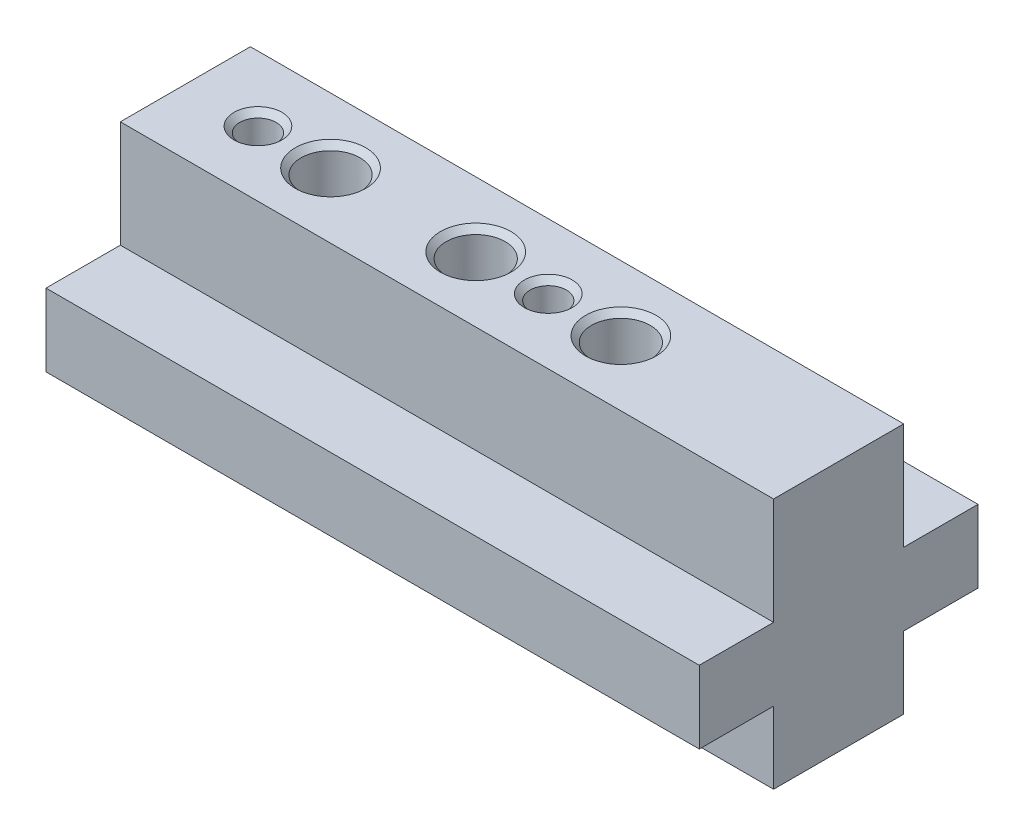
ISO-10303-21;
HEADER;
FILE_DESCRIPTION(('STEP AP214'),'2;1');
FILE_NAME('part.step','',(''),(''),'','','');
FILE_SCHEMA(('AUTOMOTIVE_DESIGN { 1 0 10303 214 1 1 1 1 }'));
ENDSEC;
DATA;
#1=APPLICATION_CONTEXT('core data for automotive mechanical design processes');
#2=APPLICATION_PROTOCOL_DEFINITION('international standard','automotive_design',2000,#1);
#3=PRODUCT_CONTEXT('',#1,'mechanical');
#4=PRODUCT('Part','Part','',(#3));
#5=PRODUCT_RELATED_PRODUCT_CATEGORY('part','',(#4));
#6=PRODUCT_DEFINITION_FORMATION('','',#4);
#7=PRODUCT_DEFINITION_CONTEXT('part definition',#1,'design');
#8=PRODUCT_DEFINITION('design','',#6,#7);
#9=PRODUCT_DEFINITION_SHAPE('','',#8);
#10=(LENGTH_UNIT() NAMED_UNIT(*) SI_UNIT(.MILLI.,.METRE.));
#11=(NAMED_UNIT(*) PLANE_ANGLE_UNIT() SI_UNIT($,.RADIAN.));
#12=(NAMED_UNIT(*) SI_UNIT($,.STERADIAN.) SOLID_ANGLE_UNIT());
#13=UNCERTAINTY_MEASURE_WITH_UNIT(LENGTH_MEASURE(1.E-05),#10,'distance_accuracy_value','');
#14=(GEOMETRIC_REPRESENTATION_CONTEXT(3) GLOBAL_UNCERTAINTY_ASSIGNED_CONTEXT((#13)) GLOBAL_UNIT_ASSIGNED_CONTEXT((#10,
#11,#12)) REPRESENTATION_CONTEXT('',''));
#15=CARTESIAN_POINT('',(0.,0.,0.));
#16=DIRECTION('',(0.,0.,1.));
#17=DIRECTION('',(1.,0.,0.));
#18=AXIS2_PLACEMENT_3D('',#15,#16,#17);
#19=CARTESIAN_POINT('',(28.575,1.5875,2.8448));
#20=DIRECTION('',(0.,-1.,0.));
#21=DIRECTION('',(0.,0.,-1.));
#22=AXIS2_PLACEMENT_3D('',#19,#20,#21);
#23=PLANE('',#22);
#24=DIRECTION('',(0.,0.,1.));
#25=VECTOR('',#24,1.);
#26=CARTESIAN_POINT('',(0.,1.5875,2.8448));
#27=LINE('',#26,#25);
#28=CARTESIAN_POINT('',(0.,1.5875,2.8448));
#29=VERTEX_POINT('',#28);
#30=CARTESIAN_POINT('',(0.,1.5875,6.096));
#31=VERTEX_POINT('',#30);
#32=EDGE_CURVE('E162',#29,#31,#27,.T.);
#33=ORIENTED_EDGE('',*,*,#32,.T.);
#34=DIRECTION('',(-1.,0.,0.));
#35=VECTOR('',#34,1.);
#36=CARTESIAN_POINT('',(28.575,1.5875,6.096));
#37=LINE('',#36,#35);
#38=CARTESIAN_POINT('',(28.575,1.5875,6.096));
#39=VERTEX_POINT('',#38);
#40=EDGE_CURVE('E210',#39,#31,#37,.T.);
#41=ORIENTED_EDGE('',*,*,#40,.F.);
#42=DIRECTION('',(0.,0.,1.));
#43=VECTOR('',#42,1.);
#44=CARTESIAN_POINT('',(28.575,1.5875,2.8448));
#45=LINE('',#44,#43);
#46=CARTESIAN_POINT('',(28.575,1.5875,2.8448));
#47=VERTEX_POINT('',#46);
#48=EDGE_CURVE('E185',#47,#39,#45,.T.);
#49=ORIENTED_EDGE('',*,*,#48,.F.);
#50=DIRECTION('',(-1.,0.,0.));
#51=VECTOR('',#50,1.);
#52=CARTESIAN_POINT('',(28.575,1.5875,2.8448));
#53=LINE('',#52,#51);
#54=EDGE_CURVE('E158',#47,#29,#53,.T.);
#55=ORIENTED_EDGE('',*,*,#54,.T.);
#56=EDGE_LOOP('',(#33,#41,#49,#55));
#57=FACE_BOUND('',#56,.T.);
#58=ADVANCED_FACE('F37',(#57),#23,.F.);
#59=CARTESIAN_POINT('',(28.575,1.5875,6.096));
#60=DIRECTION('',(0.,0.,-1.));
#61=DIRECTION('',(-1.,0.,0.));
#62=AXIS2_PLACEMENT_3D('',#59,#60,#61);
#63=PLANE('',#62);
#64=DIRECTION('',(0.,-1.,0.));
#65=VECTOR('',#64,1.);
#66=CARTESIAN_POINT('',(0.,1.5875,6.096));
#67=LINE('',#66,#65);
#68=CARTESIAN_POINT('',(0.,-1.5875,6.096));
#69=VERTEX_POINT('',#68);
#70=EDGE_CURVE('E165',#31,#69,#67,.T.);
#71=ORIENTED_EDGE('',*,*,#70,.T.);
#72=DIRECTION('',(-1.,0.,0.));
#73=VECTOR('',#72,1.);
#74=CARTESIAN_POINT('',(28.575,-1.5875,6.096));
#75=LINE('',#74,#73);
#76=CARTESIAN_POINT('',(28.575,-1.5875,6.096));
#77=VERTEX_POINT('',#76);
#78=EDGE_CURVE('E207',#77,#69,#75,.T.);
#79=ORIENTED_EDGE('',*,*,#78,.F.);
#80=DIRECTION('',(0.,-1.,0.));
#81=VECTOR('',#80,1.);
#82=CARTESIAN_POINT('',(28.575,1.5875,6.096));
#83=LINE('',#82,#81);
#84=EDGE_CURVE('E111',#39,#77,#83,.T.);
#85=ORIENTED_EDGE('',*,*,#84,.F.);
#86=ORIENTED_EDGE('',*,*,#40,.T.);
#87=EDGE_LOOP('',(#71,#79,#85,#86));
#88=FACE_BOUND('',#87,.T.);
#89=ADVANCED_FACE('F255',(#88),#63,.F.);
#90=CARTESIAN_POINT('',(28.575,-1.5875,6.096));
#91=DIRECTION('',(0.,1.,0.));
#92=DIRECTION('',(0.,0.,1.));
#93=AXIS2_PLACEMENT_3D('',#90,#91,#92);
#94=PLANE('',#93);
#95=DIRECTION('',(0.,0.,-1.));
#96=VECTOR('',#95,1.);
#97=CARTESIAN_POINT('',(0.,-1.5875,6.096));
#98=LINE('',#97,#96);
#99=CARTESIAN_POINT('',(0.,-1.5875,2.8448));
#100=VERTEX_POINT('',#99);
#101=EDGE_CURVE('E168',#69,#100,#98,.T.);
#102=ORIENTED_EDGE('',*,*,#101,.T.);
#103=DIRECTION('',(-1.,0.,0.));
#104=VECTOR('',#103,1.);
#105=CARTESIAN_POINT('',(28.575,-1.5875,2.8448));
#106=LINE('',#105,#104);
#107=CARTESIAN_POINT('',(28.575,-1.5875,2.8448));
#108=VERTEX_POINT('',#107);
#109=EDGE_CURVE('E204',#108,#100,#106,.T.);
#110=ORIENTED_EDGE('',*,*,#109,.F.);
#111=DIRECTION('',(0.,0.,-1.));
#112=VECTOR('',#111,1.);
#113=CARTESIAN_POINT('',(28.575,-1.5875,6.096));
#114=LINE('',#113,#112);
#115=EDGE_CURVE('E303',#77,#108,#114,.T.);
#116=ORIENTED_EDGE('',*,*,#115,.F.);
#117=ORIENTED_EDGE('',*,*,#78,.T.);
#118=EDGE_LOOP('',(#102,#110,#116,#117));
#119=FACE_BOUND('',#118,.T.);
#120=ADVANCED_FACE('F261',(#119),#94,.F.);
#121=CARTESIAN_POINT('',(28.575,-1.5875,2.8448));
#122=DIRECTION('',(0.,0.,-1.));
#123=DIRECTION('',(0.,1.,0.));
#124=AXIS2_PLACEMENT_3D('',#121,#122,#123);
#125=PLANE('',#124);
#126=DIRECTION('',(0.,-1.,0.));
#127=VECTOR('',#126,1.);
#128=CARTESIAN_POINT('',(0.,-1.5875,2.8448));
#129=LINE('',#128,#127);
#130=CARTESIAN_POINT('',(0.,-4.7371,2.8448));
#131=VERTEX_POINT('',#130);
#132=EDGE_CURVE('E170',#100,#131,#129,.T.);
#133=ORIENTED_EDGE('',*,*,#132,.T.);
#134=DIRECTION('',(-1.,0.,0.));
#135=VECTOR('',#134,1.);
#136=CARTESIAN_POINT('',(28.575,-4.7371,2.8448));
#137=LINE('',#136,#135);
#138=CARTESIAN_POINT('',(28.575,-4.7371,2.8448));
#139=VERTEX_POINT('',#138);
#140=EDGE_CURVE('E201',#139,#131,#137,.T.);
#141=ORIENTED_EDGE('',*,*,#140,.F.);
#142=DIRECTION('',(0.,-1.,0.));
#143=VECTOR('',#142,1.);
#144=CARTESIAN_POINT('',(28.575,-1.5875,2.8448));
#145=LINE('',#144,#143);
#146=EDGE_CURVE('E305',#108,#139,#145,.T.);
#147=ORIENTED_EDGE('',*,*,#146,.F.);
#148=ORIENTED_EDGE('',*,*,#109,.T.);
#149=EDGE_LOOP('',(#133,#141,#147,#148));
#150=FACE_BOUND('',#149,.T.);
#151=ADVANCED_FACE('F359',(#150),#125,.F.);
#152=CARTESIAN_POINT('',(28.575,-4.7371,2.8448));
#153=DIRECTION('',(0.,1.,0.));
#154=DIRECTION('',(0.,0.,1.));
#155=AXIS2_PLACEMENT_3D('',#152,#153,#154);
#156=PLANE('',#155);
#157=DIRECTION('',(0.,0.,-1.));
#158=VECTOR('',#157,1.);
#159=CARTESIAN_POINT('',(0.,-4.7371,2.8448));
#160=LINE('',#159,#158);
#161=CARTESIAN_POINT('',(0.,-4.7371,-2.8448));
#162=VERTEX_POINT('',#161);
#163=EDGE_CURVE('E172',#131,#162,#160,.T.);
#164=ORIENTED_EDGE('',*,*,#163,.T.);
#165=DIRECTION('',(-1.,0.,0.));
#166=VECTOR('',#165,1.);
#167=CARTESIAN_POINT('',(28.575,-4.7371,-2.8448));
#168=LINE('',#167,#166);
#169=CARTESIAN_POINT('',(28.575,-4.7371,-2.8448));
#170=VERTEX_POINT('',#169);
#171=EDGE_CURVE('E198',#170,#162,#168,.T.);
#172=ORIENTED_EDGE('',*,*,#171,.F.);
#173=DIRECTION('',(0.,0.,-1.));
#174=VECTOR('',#173,1.);
#175=CARTESIAN_POINT('',(28.575,-4.7371,2.8448));
#176=LINE('',#175,#174);
#177=EDGE_CURVE('E307',#139,#170,#176,.T.);
#178=ORIENTED_EDGE('',*,*,#177,.F.);
#179=ORIENTED_EDGE('',*,*,#140,.T.);
#180=EDGE_LOOP('',(#164,#172,#178,#179));
#181=FACE_BOUND('',#180,.T.);
#182=ADVANCED_FACE('F355',(#181),#156,.F.);
#183=CARTESIAN_POINT('',(28.575,-4.7371,-2.8448));
#184=DIRECTION('',(0.,0.,1.));
#185=DIRECTION('',(0.,-1.,0.));
#186=AXIS2_PLACEMENT_3D('',#183,#184,#185);
#187=PLANE('',#186);
#188=DIRECTION('',(0.,1.,0.));
#189=VECTOR('',#188,1.);
#190=CARTESIAN_POINT('',(0.,-4.7371,-2.8448));
#191=LINE('',#190,#189);
#192=CARTESIAN_POINT('',(0.,-1.5875,-2.8448));
#193=VERTEX_POINT('',#192);
#194=EDGE_CURVE('E174',#162,#193,#191,.T.);
#195=ORIENTED_EDGE('',*,*,#194,.T.);
#196=DIRECTION('',(-1.,0.,0.));
#197=VECTOR('',#196,1.);
#198=CARTESIAN_POINT('',(28.575,-1.5875,-2.8448));
#199=LINE('',#198,#197);
#200=CARTESIAN_POINT('',(28.575,-1.5875,-2.8448));
#201=VERTEX_POINT('',#200);
#202=EDGE_CURVE('E195',#201,#193,#199,.T.);
#203=ORIENTED_EDGE('',*,*,#202,.F.);
#204=DIRECTION('',(0.,1.,0.));
#205=VECTOR('',#204,1.);
#206=CARTESIAN_POINT('',(28.575,-4.7371,-2.8448));
#207=LINE('',#206,#205);
#208=EDGE_CURVE('E309',#170,#201,#207,.T.);
#209=ORIENTED_EDGE('',*,*,#208,.F.);
#210=ORIENTED_EDGE('',*,*,#171,.T.);
#211=EDGE_LOOP('',(#195,#203,#209,#210));
#212=FACE_BOUND('',#211,.T.);
#213=ADVANCED_FACE('F351',(#212),#187,.F.);
#214=CARTESIAN_POINT('',(28.575,-1.5875,-2.8448));
#215=DIRECTION('',(0.,1.,0.));
#216=DIRECTION('',(0.,0.,1.));
#217=AXIS2_PLACEMENT_3D('',#214,#215,#216);
#218=PLANE('',#217);
#219=DIRECTION('',(0.,0.,-1.));
#220=VECTOR('',#219,1.);
#221=CARTESIAN_POINT('',(0.,-1.5875,-2.8448));
#222=LINE('',#221,#220);
#223=CARTESIAN_POINT('',(0.,-1.5875,-6.096));
#224=VERTEX_POINT('',#223);
#225=EDGE_CURVE('E176',#193,#224,#222,.T.);
#226=ORIENTED_EDGE('',*,*,#225,.T.);
#227=DIRECTION('',(-1.,0.,0.));
#228=VECTOR('',#227,1.);
#229=CARTESIAN_POINT('',(28.575,-1.5875,-6.096));
#230=LINE('',#229,#228);
#231=CARTESIAN_POINT('',(28.575,-1.5875,-6.096));
#232=VERTEX_POINT('',#231);
#233=EDGE_CURVE('E192',#232,#224,#230,.T.);
#234=ORIENTED_EDGE('',*,*,#233,.F.);
#235=DIRECTION('',(0.,0.,-1.));
#236=VECTOR('',#235,1.);
#237=CARTESIAN_POINT('',(28.575,-1.5875,-2.8448));
#238=LINE('',#237,#236);
#239=EDGE_CURVE('E311',#201,#232,#238,.T.);
#240=ORIENTED_EDGE('',*,*,#239,.F.);
#241=ORIENTED_EDGE('',*,*,#202,.T.);
#242=EDGE_LOOP('',(#226,#234,#240,#241));
#243=FACE_BOUND('',#242,.T.);
#244=ADVANCED_FACE('F348',(#243),#218,.F.);
#245=CARTESIAN_POINT('',(28.575,-1.5875,-6.096));
#246=DIRECTION('',(0.,0.,1.));
#247=DIRECTION('',(1.,0.,0.));
#248=AXIS2_PLACEMENT_3D('',#245,#246,#247);
#249=PLANE('',#248);
#250=DIRECTION('',(0.,1.,0.));
#251=VECTOR('',#250,1.);
#252=CARTESIAN_POINT('',(0.,-1.5875,-6.096));
#253=LINE('',#252,#251);
#254=CARTESIAN_POINT('',(0.,1.5875,-6.096));
#255=VERTEX_POINT('',#254);
#256=EDGE_CURVE('E178',#224,#255,#253,.T.);
#257=ORIENTED_EDGE('',*,*,#256,.T.);
#258=DIRECTION('',(-1.,0.,0.));
#259=VECTOR('',#258,1.);
#260=CARTESIAN_POINT('',(28.575,1.5875,-6.096));
#261=LINE('',#260,#259);
#262=CARTESIAN_POINT('',(28.575,1.5875,-6.096));
#263=VERTEX_POINT('',#262);
#264=EDGE_CURVE('E189',#263,#255,#261,.T.);
#265=ORIENTED_EDGE('',*,*,#264,.F.);
#266=DIRECTION('',(0.,1.,0.));
#267=VECTOR('',#266,1.);
#268=CARTESIAN_POINT('',(28.575,-1.5875,-6.096));
#269=LINE('',#268,#267);
#270=EDGE_CURVE('E313',#232,#263,#269,.T.);
#271=ORIENTED_EDGE('',*,*,#270,.F.);
#272=ORIENTED_EDGE('',*,*,#233,.T.);
#273=EDGE_LOOP('',(#257,#265,#271,#272));
#274=FACE_BOUND('',#273,.T.);
#275=ADVANCED_FACE('F319',(#274),#249,.F.);
#276=CARTESIAN_POINT('',(28.575,1.5875,-6.096));
#277=DIRECTION('',(0.,-1.,0.));
#278=DIRECTION('',(0.,0.,-1.));
#279=AXIS2_PLACEMENT_3D('',#276,#277,#278);
#280=PLANE('',#279);
#281=DIRECTION('',(0.,0.,1.));
#282=VECTOR('',#281,1.);
#283=CARTESIAN_POINT('',(0.,1.5875,-6.096));
#284=LINE('',#283,#282);
#285=CARTESIAN_POINT('',(0.,1.5875,-2.8448));
#286=VERTEX_POINT('',#285);
#287=EDGE_CURVE('E180',#255,#286,#284,.T.);
#288=ORIENTED_EDGE('',*,*,#287,.T.);
#289=DIRECTION('',(-1.,0.,0.));
#290=VECTOR('',#289,1.);
#291=CARTESIAN_POINT('',(28.575,1.5875,-2.8448));
#292=LINE('',#291,#290);
#293=CARTESIAN_POINT('',(28.575,1.5875,-2.8448));
#294=VERTEX_POINT('',#293);
#295=EDGE_CURVE('E153',#294,#286,#292,.T.);
#296=ORIENTED_EDGE('',*,*,#295,.F.);
#297=DIRECTION('',(0.,0.,1.));
#298=VECTOR('',#297,1.);
#299=CARTESIAN_POINT('',(28.575,1.5875,-6.096));
#300=LINE('',#299,#298);
#301=EDGE_CURVE('E144',#263,#294,#300,.T.);
#302=ORIENTED_EDGE('',*,*,#301,.F.);
#303=ORIENTED_EDGE('',*,*,#264,.T.);
#304=EDGE_LOOP('',(#288,#296,#302,#303));
#305=FACE_BOUND('',#304,.T.);
#306=ADVANCED_FACE('F323',(#305),#280,.F.);
#307=CARTESIAN_POINT('',(28.575,1.5875,-2.8448));
#308=DIRECTION('',(0.,0.,1.));
#309=DIRECTION('',(1.,0.,0.));
#310=AXIS2_PLACEMENT_3D('',#307,#308,#309);
#311=PLANE('',#310);
#312=DIRECTION('',(0.,1.,0.));
#313=VECTOR('',#312,1.);
#314=CARTESIAN_POINT('',(0.,1.5875,-2.8448));
#315=LINE('',#314,#313);
#316=CARTESIAN_POINT('',(0.,6.2611,-2.8448));
#317=VERTEX_POINT('',#316);
#318=EDGE_CURVE('E152',#286,#317,#315,.T.);
#319=ORIENTED_EDGE('',*,*,#318,.T.);
#320=DIRECTION('',(-1.,0.,0.));
#321=VECTOR('',#320,1.);
#322=CARTESIAN_POINT('',(28.575,6.2611,-2.8448));
#323=LINE('',#322,#321);
#324=CARTESIAN_POINT('',(28.575,6.2611,-2.8448));
#325=VERTEX_POINT('',#324);
#326=EDGE_CURVE('E149',#325,#317,#323,.T.);
#327=ORIENTED_EDGE('',*,*,#326,.F.);
#328=DIRECTION('',(0.,1.,0.));
#329=VECTOR('',#328,1.);
#330=CARTESIAN_POINT('',(28.575,1.5875,-2.8448));
#331=LINE('',#330,#329);
#332=EDGE_CURVE('E138',#294,#325,#331,.T.);
#333=ORIENTED_EDGE('',*,*,#332,.F.);
#334=ORIENTED_EDGE('',*,*,#295,.T.);
#335=EDGE_LOOP('',(#319,#327,#333,#334));
#336=FACE_BOUND('',#335,.T.);
#337=ADVANCED_FACE('F150',(#336),#311,.F.);
#338=CARTESIAN_POINT('',(28.575,6.2611,-2.8448));
#339=DIRECTION('',(0.,-1.,0.));
#340=DIRECTION('',(0.,0.,-1.));
#341=AXIS2_PLACEMENT_3D('',#338,#339,#340);
#342=PLANE('',#341);
#343=CARTESIAN_POINT('',(19.05,6.2611,0.));
#344=DIRECTION('',(0.,-1.,0.));
#345=DIRECTION('',(0.,0.,-1.));
#346=AXIS2_PLACEMENT_3D('',#343,#344,#345);
#347=CIRCLE('',#346,1.54305000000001);
#348=CARTESIAN_POINT('',(19.05,6.2611,-1.54305000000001));
#349=VERTEX_POINT('',#348);
#350=EDGE_CURVE('E227',#349,#349,#347,.T.);
#351=ORIENTED_EDGE('',*,*,#350,.T.);
#352=EDGE_LOOP('',(#351));
#353=FACE_BOUND('',#352,.T.);
#354=CARTESIAN_POINT('',(15.875,6.2611,0.));
#355=DIRECTION('',(0.,-1.,0.));
#356=DIRECTION('',(0.,0.,-1.));
#357=AXIS2_PLACEMENT_3D('',#354,#355,#356);
#358=CIRCLE('',#357,1.04775000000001);
#359=CARTESIAN_POINT('',(15.875,6.2611,-1.04775000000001));
#360=VERTEX_POINT('',#359);
#361=EDGE_CURVE('E224',#360,#360,#358,.T.);
#362=ORIENTED_EDGE('',*,*,#361,.T.);
#363=EDGE_LOOP('',(#362));
#364=FACE_BOUND('',#363,.T.);
#365=CARTESIAN_POINT('',(3.175,6.2611,0.));
#366=DIRECTION('',(0.,-1.,0.));
#367=DIRECTION('',(0.,0.,-1.));
#368=AXIS2_PLACEMENT_3D('',#365,#366,#367);
#369=CIRCLE('',#368,1.04775000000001);
#370=CARTESIAN_POINT('',(3.175,6.2611,-1.04775000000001));
#371=VERTEX_POINT('',#370);
#372=EDGE_CURVE('E221',#371,#371,#369,.T.);
#373=ORIENTED_EDGE('',*,*,#372,.T.);
#374=EDGE_LOOP('',(#373));
#375=FACE_BOUND('',#374,.T.);
#376=CARTESIAN_POINT('',(12.7,6.2611,0.));
#377=DIRECTION('',(0.,-1.,0.));
#378=DIRECTION('',(0.,0.,-1.));
#379=AXIS2_PLACEMENT_3D('',#376,#377,#378);
#380=CIRCLE('',#379,1.54305000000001);
#381=CARTESIAN_POINT('',(12.7,6.2611,-1.54305000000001));
#382=VERTEX_POINT('',#381);
#383=EDGE_CURVE('E218',#382,#382,#380,.T.);
#384=ORIENTED_EDGE('',*,*,#383,.T.);
#385=EDGE_LOOP('',(#384));
#386=FACE_BOUND('',#385,.T.);
#387=CARTESIAN_POINT('',(6.35,6.2611,0.));
#388=DIRECTION('',(0.,-1.,0.));
#389=DIRECTION('',(0.,0.,-1.));
#390=AXIS2_PLACEMENT_3D('',#387,#388,#389);
#391=CIRCLE('',#390,1.54305000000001);
#392=CARTESIAN_POINT('',(6.35,6.2611,-1.54305000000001));
#393=VERTEX_POINT('',#392);
#394=EDGE_CURVE('E215',#393,#393,#391,.T.);
#395=ORIENTED_EDGE('',*,*,#394,.T.);
#396=EDGE_LOOP('',(#395));
#397=FACE_BOUND('',#396,.T.);
#398=DIRECTION('',(0.,0.,1.));
#399=VECTOR('',#398,1.);
#400=CARTESIAN_POINT('',(0.,6.2611,-2.8448));
#401=LINE('',#400,#399);
#402=CARTESIAN_POINT('',(0.,6.2611,2.8448));
#403=VERTEX_POINT('',#402);
#404=EDGE_CURVE('E96',#317,#403,#401,.T.);
#405=ORIENTED_EDGE('',*,*,#404,.T.);
#406=DIRECTION('',(-1.,0.,0.));
#407=VECTOR('',#406,1.);
#408=CARTESIAN_POINT('',(28.575,6.2611,2.8448));
#409=LINE('',#408,#407);
#410=CARTESIAN_POINT('',(28.575,6.2611,2.8448));
#411=VERTEX_POINT('',#410);
#412=EDGE_CURVE('E154',#411,#403,#409,.T.);
#413=ORIENTED_EDGE('',*,*,#412,.F.);
#414=DIRECTION('',(0.,0.,1.));
#415=VECTOR('',#414,1.);
#416=CARTESIAN_POINT('',(28.575,6.2611,-2.8448));
#417=LINE('',#416,#415);
#418=EDGE_CURVE('E142',#325,#411,#417,.T.);
#419=ORIENTED_EDGE('',*,*,#418,.F.);
#420=ORIENTED_EDGE('',*,*,#326,.T.);
#421=EDGE_LOOP('',(#405,#413,#419,#420));
#422=FACE_BOUND('',#421,.T.);
#423=ADVANCED_FACE('F156',(#353,#364,#375,#386,#397,#422),#342,.F.);
#424=CARTESIAN_POINT('',(28.575,6.2611,2.8448));
#425=DIRECTION('',(0.,0.,-1.));
#426=DIRECTION('',(-1.,0.,0.));
#427=AXIS2_PLACEMENT_3D('',#424,#425,#426);
#428=PLANE('',#427);
#429=DIRECTION('',(0.,-1.,0.));
#430=VECTOR('',#429,1.);
#431=CARTESIAN_POINT('',(0.,6.2611,2.8448));
#432=LINE('',#431,#430);
#433=EDGE_CURVE('E102',#403,#29,#432,.T.);
#434=ORIENTED_EDGE('',*,*,#433,.T.);
#435=ORIENTED_EDGE('',*,*,#54,.F.);
#436=DIRECTION('',(0.,-1.,0.));
#437=VECTOR('',#436,1.);
#438=CARTESIAN_POINT('',(28.575,6.2611,2.8448));
#439=LINE('',#438,#437);
#440=EDGE_CURVE('E54',#411,#47,#439,.T.);
#441=ORIENTED_EDGE('',*,*,#440,.F.);
#442=ORIENTED_EDGE('',*,*,#412,.T.);
#443=EDGE_LOOP('',(#434,#435,#441,#442));
#444=FACE_BOUND('',#443,.T.);
#445=ADVANCED_FACE('F330',(#444),#428,.F.);
#446=CARTESIAN_POINT('',(28.575,1.5875,6.096));
#447=DIRECTION('',(1.,0.,0.));
#448=DIRECTION('',(0.,0.,-1.));
#449=AXIS2_PLACEMENT_3D('',#446,#447,#448);
#450=PLANE('',#449);
#451=ORIENTED_EDGE('',*,*,#48,.T.);
#452=ORIENTED_EDGE('',*,*,#84,.T.);
#453=ORIENTED_EDGE('',*,*,#115,.T.);
#454=ORIENTED_EDGE('',*,*,#146,.T.);
#455=ORIENTED_EDGE('',*,*,#177,.T.);
#456=ORIENTED_EDGE('',*,*,#208,.T.);
#457=ORIENTED_EDGE('',*,*,#239,.T.);
#458=ORIENTED_EDGE('',*,*,#270,.T.);
#459=ORIENTED_EDGE('',*,*,#301,.T.);
#460=ORIENTED_EDGE('',*,*,#332,.T.);
#461=ORIENTED_EDGE('',*,*,#418,.T.);
#462=ORIENTED_EDGE('',*,*,#440,.T.);
#463=EDGE_LOOP('',(#451,#452,#453,#454,#455,#456,#457,#458,#459,#460,#461,#462));
#464=FACE_BOUND('',#463,.T.);
#465=ADVANCED_FACE('F140',(#464),#450,.T.);
#466=CARTESIAN_POINT('',(0.,1.5875,6.096));
#467=DIRECTION('',(1.,0.,0.));
#468=DIRECTION('',(0.,0.,-1.));
#469=AXIS2_PLACEMENT_3D('',#466,#467,#468);
#470=PLANE('',#469);
#471=ORIENTED_EDGE('',*,*,#32,.F.);
#472=ORIENTED_EDGE('',*,*,#433,.F.);
#473=ORIENTED_EDGE('',*,*,#404,.F.);
#474=ORIENTED_EDGE('',*,*,#318,.F.);
#475=ORIENTED_EDGE('',*,*,#287,.F.);
#476=ORIENTED_EDGE('',*,*,#256,.F.);
#477=ORIENTED_EDGE('',*,*,#225,.F.);
#478=ORIENTED_EDGE('',*,*,#194,.F.);
#479=ORIENTED_EDGE('',*,*,#163,.F.);
#480=ORIENTED_EDGE('',*,*,#132,.F.);
#481=ORIENTED_EDGE('',*,*,#101,.F.);
#482=ORIENTED_EDGE('',*,*,#70,.F.);
#483=EDGE_LOOP('',(#471,#472,#473,#474,#475,#476,#477,#478,#479,#480,#481,#482));
#484=FACE_BOUND('',#483,.T.);
#485=ADVANCED_FACE('F326',(#484),#470,.F.);
#486=CARTESIAN_POINT('',(19.05,-0.4191,0.));
#487=DIRECTION('',(0.,1.,0.));
#488=DIRECTION('',(0.,0.,1.));
#489=AXIS2_PLACEMENT_3D('',#486,#487,#488);
#490=CONICAL_SURFACE('',#489,1.28905,1.02974425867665);
#491=CARTESIAN_POINT('',(19.05,-1.19363938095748,0.));
#492=VERTEX_POINT('',#491);
#493=VERTEX_LOOP('',#492);
#494=FACE_BOUND('',#493,.T.);
#495=CARTESIAN_POINT('',(19.05,-0.4191,0.));
#496=DIRECTION('',(0.,1.,0.));
#497=DIRECTION('',(0.,0.,1.));
#498=AXIS2_PLACEMENT_3D('',#495,#496,#497);
#499=CIRCLE('',#498,1.28905);
#500=CARTESIAN_POINT('',(19.05,-0.4191,1.28905));
#501=VERTEX_POINT('',#500);
#502=EDGE_CURVE('E166',#501,#501,#499,.T.);
#503=ORIENTED_EDGE('',*,*,#502,.T.);
#504=EDGE_LOOP('',(#503));
#505=FACE_BOUND('',#504,.T.);
#506=ADVANCED_FACE('F431',(#494,#505),#490,.F.);
#507=CARTESIAN_POINT('',(19.05,6.2611,0.));
#508=DIRECTION('',(0.,1.,0.));
#509=DIRECTION('',(0.,0.,1.));
#510=AXIS2_PLACEMENT_3D('',#507,#508,#509);
#511=CYLINDRICAL_SURFACE('',#510,1.28905);
#512=CARTESIAN_POINT('',(19.05,6.00709999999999,0.));
#513=DIRECTION('',(0.,-1.,0.));
#514=DIRECTION('',(0.,0.,-1.));
#515=AXIS2_PLACEMENT_3D('',#512,#513,#514);
#516=CIRCLE('',#515,1.28905);
#517=CARTESIAN_POINT('',(19.05,6.00709999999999,-1.28905));
#518=VERTEX_POINT('',#517);
#519=EDGE_CURVE('E212',#518,#518,#516,.F.);
#520=ORIENTED_EDGE('',*,*,#519,.T.);
#521=EDGE_LOOP('',(#520));
#522=FACE_BOUND('',#521,.T.);
#523=ORIENTED_EDGE('',*,*,#502,.F.);
#524=EDGE_LOOP('',(#523));
#525=FACE_BOUND('',#524,.T.);
#526=ADVANCED_FACE('F424',(#522,#525),#511,.F.);
#527=CARTESIAN_POINT('',(12.7,-0.4191,0.));
#528=DIRECTION('',(0.,1.,0.));
#529=DIRECTION('',(0.,0.,1.));
#530=AXIS2_PLACEMENT_3D('',#527,#528,#529);
#531=CONICAL_SURFACE('',#530,1.28905,1.02974425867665);
#532=CARTESIAN_POINT('',(12.7,-1.19363938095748,0.));
#533=VERTEX_POINT('',#532);
#534=VERTEX_LOOP('',#533);
#535=FACE_BOUND('',#534,.T.);
#536=CARTESIAN_POINT('',(12.7,-0.4191,0.));
#537=DIRECTION('',(0.,1.,0.));
#538=DIRECTION('',(0.,0.,1.));
#539=AXIS2_PLACEMENT_3D('',#536,#537,#538);
#540=CIRCLE('',#539,1.28905);
#541=CARTESIAN_POINT('',(12.7,-0.4191,1.28905));
#542=VERTEX_POINT('',#541);
#543=EDGE_CURVE('E292',#542,#542,#540,.T.);
#544=ORIENTED_EDGE('',*,*,#543,.T.);
#545=EDGE_LOOP('',(#544));
#546=FACE_BOUND('',#545,.T.);
#547=ADVANCED_FACE('F430',(#535,#546),#531,.F.);
#548=CARTESIAN_POINT('',(12.7,6.2611,0.));
#549=DIRECTION('',(0.,1.,0.));
#550=DIRECTION('',(0.,0.,1.));
#551=AXIS2_PLACEMENT_3D('',#548,#549,#550);
#552=CYLINDRICAL_SURFACE('',#551,1.28905);
#553=CARTESIAN_POINT('',(12.7,6.00709999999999,0.));
#554=DIRECTION('',(0.,-1.,0.));
#555=DIRECTION('',(0.,0.,-1.));
#556=AXIS2_PLACEMENT_3D('',#553,#554,#555);
#557=CIRCLE('',#556,1.28905);
#558=CARTESIAN_POINT('',(12.7,6.00709999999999,-1.28905));
#559=VERTEX_POINT('',#558);
#560=EDGE_CURVE('E46',#559,#559,#557,.F.);
#561=ORIENTED_EDGE('',*,*,#560,.T.);
#562=EDGE_LOOP('',(#561));
#563=FACE_BOUND('',#562,.T.);
#564=ORIENTED_EDGE('',*,*,#543,.F.);
#565=EDGE_LOOP('',(#564));
#566=FACE_BOUND('',#565,.T.);
#567=ADVANCED_FACE('F238',(#563,#566),#552,.F.);
#568=CARTESIAN_POINT('',(6.35,-0.4191,0.));
#569=DIRECTION('',(0.,1.,0.));
#570=DIRECTION('',(0.,0.,1.));
#571=AXIS2_PLACEMENT_3D('',#568,#569,#570);
#572=CONICAL_SURFACE('',#571,1.28905,1.02974425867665);
#573=CARTESIAN_POINT('',(6.35,-1.19363938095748,0.));
#574=VERTEX_POINT('',#573);
#575=VERTEX_LOOP('',#574);
#576=FACE_BOUND('',#575,.T.);
#577=CARTESIAN_POINT('',(6.35,-0.4191,0.));
#578=DIRECTION('',(0.,1.,0.));
#579=DIRECTION('',(0.,0.,1.));
#580=AXIS2_PLACEMENT_3D('',#577,#578,#579);
#581=CIRCLE('',#580,1.28905);
#582=CARTESIAN_POINT('',(6.35,-0.4191,1.28905));
#583=VERTEX_POINT('',#582);
#584=EDGE_CURVE('E288',#583,#583,#581,.T.);
#585=ORIENTED_EDGE('',*,*,#584,.T.);
#586=EDGE_LOOP('',(#585));
#587=FACE_BOUND('',#586,.T.);
#588=ADVANCED_FACE('F445',(#576,#587),#572,.F.);
#589=CARTESIAN_POINT('',(6.35,6.2611,0.));
#590=DIRECTION('',(0.,1.,0.));
#591=DIRECTION('',(0.,0.,1.));
#592=AXIS2_PLACEMENT_3D('',#589,#590,#591);
#593=CYLINDRICAL_SURFACE('',#592,1.28905);
#594=CARTESIAN_POINT('',(6.35,6.00709999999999,0.));
#595=DIRECTION('',(0.,-1.,0.));
#596=DIRECTION('',(0.,0.,-1.));
#597=AXIS2_PLACEMENT_3D('',#594,#595,#596);
#598=CIRCLE('',#597,1.28905);
#599=CARTESIAN_POINT('',(6.35,6.00709999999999,-1.28905));
#600=VERTEX_POINT('',#599);
#601=EDGE_CURVE('E11',#600,#600,#598,.F.);
#602=ORIENTED_EDGE('',*,*,#601,.T.);
#603=EDGE_LOOP('',(#602));
#604=FACE_BOUND('',#603,.T.);
#605=ORIENTED_EDGE('',*,*,#584,.F.);
#606=EDGE_LOOP('',(#605));
#607=FACE_BOUND('',#606,.T.);
#608=ADVANCED_FACE('F453',(#604,#607),#593,.F.);
#609=CARTESIAN_POINT('',(15.875,3.0861,0.));
#610=DIRECTION('',(0.,1.,0.));
#611=DIRECTION('',(0.,0.,1.));
#612=AXIS2_PLACEMENT_3D('',#609,#610,#611);
#613=CONICAL_SURFACE('',#612,0.793749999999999,1.02974425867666);
#614=CARTESIAN_POINT('',(15.875,2.60916688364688,0.));
#615=VERTEX_POINT('',#614);
#616=VERTEX_LOOP('',#615);
#617=FACE_BOUND('',#616,.T.);
#618=CARTESIAN_POINT('',(15.875,3.0861,0.));
#619=DIRECTION('',(0.,1.,0.));
#620=DIRECTION('',(0.,0.,1.));
#621=AXIS2_PLACEMENT_3D('',#618,#619,#620);
#622=CIRCLE('',#621,0.793749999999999);
#623=CARTESIAN_POINT('',(15.875,3.0861,0.79375));
#624=VERTEX_POINT('',#623);
#625=EDGE_CURVE('E286',#624,#624,#622,.T.);
#626=ORIENTED_EDGE('',*,*,#625,.T.);
#627=EDGE_LOOP('',(#626));
#628=FACE_BOUND('',#627,.T.);
#629=ADVANCED_FACE('F282',(#617,#628),#613,.F.);
#630=CARTESIAN_POINT('',(15.875,6.2611,0.));
#631=DIRECTION('',(0.,1.,0.));
#632=DIRECTION('',(0.,0.,1.));
#633=AXIS2_PLACEMENT_3D('',#630,#631,#632);
#634=CYLINDRICAL_SURFACE('',#633,0.793749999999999);
#635=CARTESIAN_POINT('',(15.875,6.00709999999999,0.));
#636=DIRECTION('',(0.,-1.,0.));
#637=DIRECTION('',(0.,0.,-1.));
#638=AXIS2_PLACEMENT_3D('',#635,#636,#637);
#639=CIRCLE('',#638,0.793749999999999);
#640=CARTESIAN_POINT('',(15.875,6.00709999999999,-0.793749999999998));
#641=VERTEX_POINT('',#640);
#642=EDGE_CURVE('E230',#641,#641,#639,.F.);
#643=ORIENTED_EDGE('',*,*,#642,.T.);
#644=EDGE_LOOP('',(#643));
#645=FACE_BOUND('',#644,.T.);
#646=ORIENTED_EDGE('',*,*,#625,.F.);
#647=EDGE_LOOP('',(#646));
#648=FACE_BOUND('',#647,.T.);
#649=ADVANCED_FACE('F278',(#645,#648),#634,.F.);
#650=CARTESIAN_POINT('',(3.175,3.0861,0.));
#651=DIRECTION('',(0.,1.,0.));
#652=DIRECTION('',(0.,0.,1.));
#653=AXIS2_PLACEMENT_3D('',#650,#651,#652);
#654=CONICAL_SURFACE('',#653,0.793749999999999,1.02974425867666);
#655=CARTESIAN_POINT('',(3.175,2.60916688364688,0.));
#656=VERTEX_POINT('',#655);
#657=VERTEX_LOOP('',#656);
#658=FACE_BOUND('',#657,.T.);
#659=CARTESIAN_POINT('',(3.175,3.0861,0.));
#660=DIRECTION('',(0.,1.,0.));
#661=DIRECTION('',(0.,0.,1.));
#662=AXIS2_PLACEMENT_3D('',#659,#660,#661);
#663=CIRCLE('',#662,0.793749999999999);
#664=CARTESIAN_POINT('',(3.175,3.0861,0.79375));
#665=VERTEX_POINT('',#664);
#666=EDGE_CURVE('E289',#665,#665,#663,.T.);
#667=ORIENTED_EDGE('',*,*,#666,.T.);
#668=EDGE_LOOP('',(#667));
#669=FACE_BOUND('',#668,.T.);
#670=ADVANCED_FACE('F281',(#658,#669),#654,.F.);
#671=CARTESIAN_POINT('',(3.175,6.2611,0.));
#672=DIRECTION('',(0.,1.,0.));
#673=DIRECTION('',(0.,0.,1.));
#674=AXIS2_PLACEMENT_3D('',#671,#672,#673);
#675=CYLINDRICAL_SURFACE('',#674,0.79375);
#676=CARTESIAN_POINT('',(3.175,6.00709999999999,0.));
#677=DIRECTION('',(0.,-1.,0.));
#678=DIRECTION('',(0.,0.,-1.));
#679=AXIS2_PLACEMENT_3D('',#676,#677,#678);
#680=CIRCLE('',#679,0.79375);
#681=CARTESIAN_POINT('',(3.175,6.00709999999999,-0.793749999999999));
#682=VERTEX_POINT('',#681);
#683=EDGE_CURVE('E233',#682,#682,#680,.F.);
#684=ORIENTED_EDGE('',*,*,#683,.T.);
#685=EDGE_LOOP('',(#684));
#686=FACE_BOUND('',#685,.T.);
#687=ORIENTED_EDGE('',*,*,#666,.F.);
#688=EDGE_LOOP('',(#687));
#689=FACE_BOUND('',#688,.T.);
#690=ADVANCED_FACE('F268',(#686,#689),#675,.F.);
#691=CARTESIAN_POINT('',(19.05,6.00709999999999,0.));
#692=DIRECTION('',(0.,1.,0.));
#693=DIRECTION('',(0.,0.,1.));
#694=AXIS2_PLACEMENT_3D('',#691,#692,#693);
#695=CONICAL_SURFACE('',#694,1.28905,0.785398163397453);
#696=ORIENTED_EDGE('',*,*,#350,.F.);
#697=EDGE_LOOP('',(#696));
#698=FACE_BOUND('',#697,.T.);
#699=ORIENTED_EDGE('',*,*,#519,.F.);
#700=EDGE_LOOP('',(#699));
#701=FACE_BOUND('',#700,.T.);
#702=ADVANCED_FACE('F265',(#698,#701),#695,.F.);
#703=CARTESIAN_POINT('',(15.875,6.00709999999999,0.));
#704=DIRECTION('',(0.,1.,0.));
#705=DIRECTION('',(0.,0.,1.));
#706=AXIS2_PLACEMENT_3D('',#703,#704,#705);
#707=CONICAL_SURFACE('',#706,0.793749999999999,0.78539816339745);
#708=ORIENTED_EDGE('',*,*,#361,.F.);
#709=EDGE_LOOP('',(#708));
#710=FACE_BOUND('',#709,.T.);
#711=ORIENTED_EDGE('',*,*,#642,.F.);
#712=EDGE_LOOP('',(#711));
#713=FACE_BOUND('',#712,.T.);
#714=ADVANCED_FACE('F250',(#710,#713),#707,.F.);
#715=CARTESIAN_POINT('',(3.175,6.00709999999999,0.));
#716=DIRECTION('',(0.,1.,0.));
#717=DIRECTION('',(0.,0.,1.));
#718=AXIS2_PLACEMENT_3D('',#715,#716,#717);
#719=CONICAL_SURFACE('',#718,0.79375,0.785398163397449);
#720=ORIENTED_EDGE('',*,*,#372,.F.);
#721=EDGE_LOOP('',(#720));
#722=FACE_BOUND('',#721,.T.);
#723=ORIENTED_EDGE('',*,*,#683,.F.);
#724=EDGE_LOOP('',(#723));
#725=FACE_BOUND('',#724,.T.);
#726=ADVANCED_FACE('F243',(#722,#725),#719,.F.);
#727=CARTESIAN_POINT('',(12.7,6.00709999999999,0.));
#728=DIRECTION('',(0.,1.,0.));
#729=DIRECTION('',(0.,0.,1.));
#730=AXIS2_PLACEMENT_3D('',#727,#728,#729);
#731=CONICAL_SURFACE('',#730,1.28905,0.785398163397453);
#732=ORIENTED_EDGE('',*,*,#383,.F.);
#733=EDGE_LOOP('',(#732));
#734=FACE_BOUND('',#733,.T.);
#735=ORIENTED_EDGE('',*,*,#560,.F.);
#736=EDGE_LOOP('',(#735));
#737=FACE_BOUND('',#736,.T.);
#738=ADVANCED_FACE('F241',(#734,#737),#731,.F.);
#739=CARTESIAN_POINT('',(6.35,6.00709999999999,0.));
#740=DIRECTION('',(0.,1.,0.));
#741=DIRECTION('',(0.,0.,1.));
#742=AXIS2_PLACEMENT_3D('',#739,#740,#741);
#743=CONICAL_SURFACE('',#742,1.28905,0.785398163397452);
#744=ORIENTED_EDGE('',*,*,#394,.F.);
#745=EDGE_LOOP('',(#744));
#746=FACE_BOUND('',#745,.T.);
#747=ORIENTED_EDGE('',*,*,#601,.F.);
#748=EDGE_LOOP('',(#747));
#749=FACE_BOUND('',#748,.T.);
#750=ADVANCED_FACE('F39',(#746,#749),#743,.F.);
#751=CLOSED_SHELL('',(#58,#89,#120,#151,#182,#213,#244,#275,#306,#337,#423,#445,#465,#485,#506,
#526,#547,#567,#588,#608,#629,#649,#670,#690,#702,#714,#726,#738,#750));
#752=MANIFOLD_SOLID_BREP('B2',#751);
#753=ADVANCED_BREP_SHAPE_REPRESENTATION('',(#18,#752),#14);
#754=SHAPE_DEFINITION_REPRESENTATION(#9,#753);
ENDSEC;
END-ISO-10303-21;
